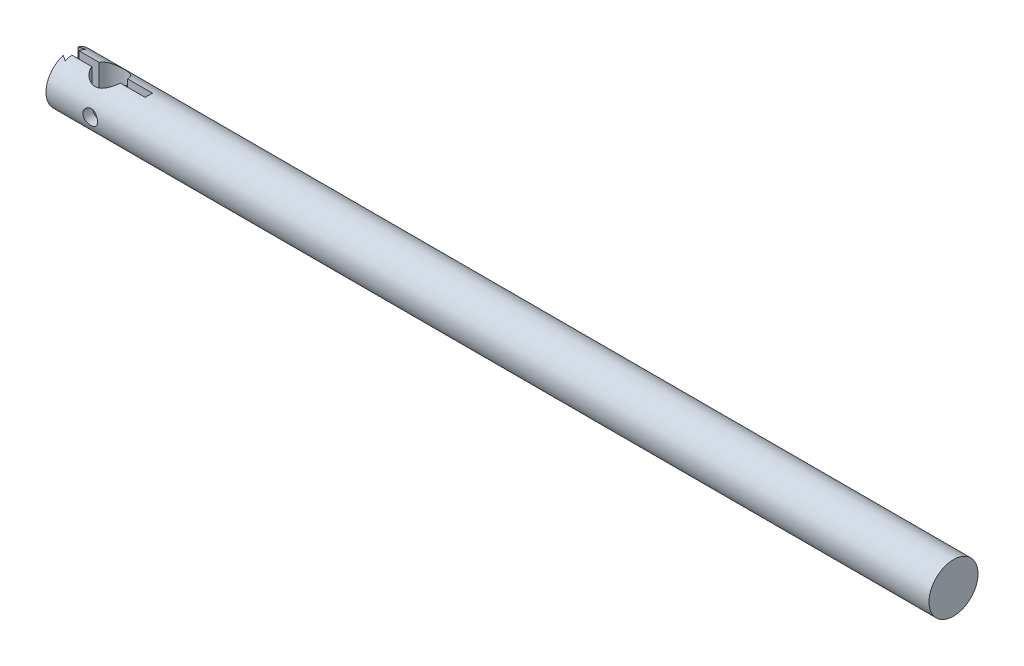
ISO-10303-21;
HEADER;
FILE_DESCRIPTION(('STEP AP214'),'2;1');
FILE_NAME('part.step','',(''),(''),'','','');
FILE_SCHEMA(('AUTOMOTIVE_DESIGN { 1 0 10303 214 1 1 1 1 }'));
ENDSEC;
DATA;
#1=APPLICATION_CONTEXT('core data for automotive mechanical design processes');
#2=APPLICATION_PROTOCOL_DEFINITION('international standard','automotive_design',2000,#1);
#3=PRODUCT_CONTEXT('',#1,'mechanical');
#4=PRODUCT('Part','Part','',(#3));
#5=PRODUCT_RELATED_PRODUCT_CATEGORY('part','',(#4));
#6=PRODUCT_DEFINITION_FORMATION('','',#4);
#7=PRODUCT_DEFINITION_CONTEXT('part definition',#1,'design');
#8=PRODUCT_DEFINITION('design','',#6,#7);
#9=PRODUCT_DEFINITION_SHAPE('','',#8);
#10=(LENGTH_UNIT() NAMED_UNIT(*) SI_UNIT(.MILLI.,.METRE.));
#11=(NAMED_UNIT(*) PLANE_ANGLE_UNIT() SI_UNIT($,.RADIAN.));
#12=(NAMED_UNIT(*) SI_UNIT($,.STERADIAN.) SOLID_ANGLE_UNIT());
#13=UNCERTAINTY_MEASURE_WITH_UNIT(LENGTH_MEASURE(1.E-05),#10,'distance_accuracy_value','');
#14=(GEOMETRIC_REPRESENTATION_CONTEXT(3) GLOBAL_UNCERTAINTY_ASSIGNED_CONTEXT((#13)) GLOBAL_UNIT_ASSIGNED_CONTEXT((#10,
#11,#12)) REPRESENTATION_CONTEXT('',''));
#15=CARTESIAN_POINT('',(0.,0.,0.));
#16=DIRECTION('',(0.,0.,1.));
#17=DIRECTION('',(1.,0.,0.));
#18=AXIS2_PLACEMENT_3D('',#15,#16,#17);
#19=CARTESIAN_POINT('',(1.,-20.,-0.75));
#20=DIRECTION('',(0.,0.,-1.));
#21=DIRECTION('',(-1.,0.,0.));
#22=AXIS2_PLACEMENT_3D('',#19,#20,#21);
#23=PLANE('',#22);
#24=DIRECTION('',(-1.,0.,0.));
#25=VECTOR('',#24,1.);
#26=CARTESIAN_POINT('',(-14.4387919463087,-4.9434299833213,-0.75));
#27=LINE('',#26,#25);
#28=CARTESIAN_POINT('',(5.09526249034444,-4.9434299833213,-0.75));
#29=VERTEX_POINT('',#28);
#30=CARTESIAN_POINT('',(1.,-4.9434299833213,-0.75));
#31=VERTEX_POINT('',#30);
#32=EDGE_CURVE('E153',#29,#31,#27,.T.);
#33=ORIENTED_EDGE('',*,*,#32,.F.);
#34=DIRECTION('',(0.,1.,0.));
#35=VECTOR('',#34,1.);
#36=CARTESIAN_POINT('',(5.09526249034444,-15.,-0.75));
#37=LINE('',#36,#35);
#38=CARTESIAN_POINT('',(5.09526249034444,4.9434299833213,-0.75));
#39=VERTEX_POINT('',#38);
#40=EDGE_CURVE('E243',#29,#39,#37,.T.);
#41=ORIENTED_EDGE('',*,*,#40,.T.);
#42=DIRECTION('',(-1.,0.,0.));
#43=VECTOR('',#42,1.);
#44=CARTESIAN_POINT('',(-14.4387919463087,4.9434299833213,-0.75));
#45=LINE('',#44,#43);
#46=CARTESIAN_POINT('',(1.,4.94342998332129,-0.75));
#47=VERTEX_POINT('',#46);
#48=EDGE_CURVE('E150',#47,#39,#45,.F.);
#49=ORIENTED_EDGE('',*,*,#48,.F.);
#50=DIRECTION('',(0.,1.,0.));
#51=VECTOR('',#50,1.);
#52=CARTESIAN_POINT('',(1.,-20.,-0.75));
#53=LINE('',#52,#51);
#54=EDGE_CURVE('E188',#31,#47,#53,.T.);
#55=ORIENTED_EDGE('',*,*,#54,.F.);
#56=EDGE_LOOP('',(#33,#41,#49,#55));
#57=FACE_BOUND('',#56,.T.);
#58=ADVANCED_FACE('F28',(#57),#23,.F.);
#59=CARTESIAN_POINT('',(16.,-20.,0.75));
#60=DIRECTION('',(0.,0.,1.));
#61=DIRECTION('',(1.,0.,0.));
#62=AXIS2_PLACEMENT_3D('',#59,#60,#61);
#63=PLANE('',#62);
#64=DIRECTION('',(-1.,0.,0.));
#65=VECTOR('',#64,1.);
#66=CARTESIAN_POINT('',(-14.4387919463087,-4.9434299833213,0.750000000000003));
#67=LINE('',#66,#65);
#68=CARTESIAN_POINT('',(10.9047375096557,-4.94342998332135,0.750000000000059));
#69=VERTEX_POINT('',#68);
#70=CARTESIAN_POINT('',(16.,-4.9434299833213,0.75));
#71=VERTEX_POINT('',#70);
#72=EDGE_CURVE('E146',#69,#71,#67,.F.);
#73=ORIENTED_EDGE('',*,*,#72,.F.);
#74=DIRECTION('',(0.,1.,0.));
#75=VECTOR('',#74,1.);
#76=CARTESIAN_POINT('',(10.9047375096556,-15.,0.75));
#77=LINE('',#76,#75);
#78=CARTESIAN_POINT('',(10.9047375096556,4.9434299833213,0.750000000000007));
#79=VERTEX_POINT('',#78);
#80=EDGE_CURVE('E240',#69,#79,#77,.T.);
#81=ORIENTED_EDGE('',*,*,#80,.T.);
#82=DIRECTION('',(-1.,0.,0.));
#83=VECTOR('',#82,1.);
#84=CARTESIAN_POINT('',(-14.4387919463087,4.9434299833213,0.750000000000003));
#85=LINE('',#84,#83);
#86=CARTESIAN_POINT('',(16.,4.94342998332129,0.75));
#87=VERTEX_POINT('',#86);
#88=EDGE_CURVE('E136',#87,#79,#85,.T.);
#89=ORIENTED_EDGE('',*,*,#88,.F.);
#90=DIRECTION('',(0.,1.,0.));
#91=VECTOR('',#90,1.);
#92=CARTESIAN_POINT('',(16.,-20.,0.75));
#93=LINE('',#92,#91);
#94=EDGE_CURVE('E199',#71,#87,#93,.T.);
#95=ORIENTED_EDGE('',*,*,#94,.F.);
#96=EDGE_LOOP('',(#73,#81,#89,#95));
#97=FACE_BOUND('',#96,.T.);
#98=ADVANCED_FACE('F203',(#97),#63,.F.);
#99=CARTESIAN_POINT('',(1.,-20.,2.07735026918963));
#100=DIRECTION('',(1.,0.,0.));
#101=DIRECTION('',(0.,0.,-1.));
#102=AXIS2_PLACEMENT_3D('',#99,#100,#101);
#103=PLANE('',#102);
#104=CARTESIAN_POINT('',(1.,0.,0.));
#105=DIRECTION('',(1.,0.,0.));
#106=DIRECTION('',(0.,0.,-1.));
#107=AXIS2_PLACEMENT_3D('',#104,#105,#106);
#108=CIRCLE('',#107,5.);
#109=CARTESIAN_POINT('',(1.,-4.54803428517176,-2.07735026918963));
#110=VERTEX_POINT('',#109);
#111=EDGE_CURVE('E313',#31,#110,#108,.T.);
#112=ORIENTED_EDGE('',*,*,#111,.F.);
#113=ORIENTED_EDGE('',*,*,#54,.T.);
#114=CARTESIAN_POINT('',(1.,4.54803428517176,-2.07735026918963));
#115=VERTEX_POINT('',#114);
#116=EDGE_CURVE('E179',#115,#47,#108,.T.);
#117=ORIENTED_EDGE('',*,*,#116,.F.);
#118=DIRECTION('',(0.,1.,0.));
#119=VECTOR('',#118,1.);
#120=CARTESIAN_POINT('',(1.,-20.,-2.07735026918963));
#121=LINE('',#120,#119);
#122=EDGE_CURVE('E161',#110,#115,#121,.T.);
#123=ORIENTED_EDGE('',*,*,#122,.F.);
#124=EDGE_LOOP('',(#112,#113,#117,#123));
#125=FACE_BOUND('',#124,.T.);
#126=ADVANCED_FACE('F264',(#125),#103,.F.);
#127=CARTESIAN_POINT('',(0.,0.,0.));
#128=DIRECTION('',(1.,0.,0.));
#129=DIRECTION('',(0.,0.,-1.));
#130=AXIS2_PLACEMENT_3D('',#127,#128,#129);
#131=PLANE('',#130);
#132=CARTESIAN_POINT('',(0.,0.,0.));
#133=DIRECTION('',(-1.,0.,0.));
#134=DIRECTION('',(0.,0.,1.));
#135=AXIS2_PLACEMENT_3D('',#132,#133,#134);
#136=CIRCLE('',#135,5.);
#137=CARTESIAN_POINT('',(0.,4.76969600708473,-1.5));
#138=VERTEX_POINT('',#137);
#139=CARTESIAN_POINT('',(0.,-4.76969600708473,-1.5));
#140=VERTEX_POINT('',#139);
#141=EDGE_CURVE('E173',#138,#140,#136,.T.);
#142=ORIENTED_EDGE('',*,*,#141,.T.);
#143=DIRECTION('',(0.,1.,0.));
#144=VECTOR('',#143,1.);
#145=CARTESIAN_POINT('',(0.,-20.,-1.5));
#146=LINE('',#145,#144);
#147=EDGE_CURVE('E157',#140,#138,#146,.T.);
#148=ORIENTED_EDGE('',*,*,#147,.T.);
#149=EDGE_LOOP('',(#142,#148));
#150=FACE_BOUND('',#149,.T.);
#151=ADVANCED_FACE('F296',(#150),#131,.F.);
#152=CARTESIAN_POINT('',(0.,-4.76969600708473,1.5));
#153=VERTEX_POINT('',#152);
#154=CARTESIAN_POINT('',(0.,4.76969600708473,1.5));
#155=VERTEX_POINT('',#154);
#156=EDGE_CURVE('E170',#153,#155,#136,.T.);
#157=ORIENTED_EDGE('',*,*,#156,.T.);
#158=DIRECTION('',(0.,1.,0.));
#159=VECTOR('',#158,1.);
#160=CARTESIAN_POINT('',(0.,-20.,1.5));
#161=LINE('',#160,#159);
#162=EDGE_CURVE('E156',#153,#155,#161,.T.);
#163=ORIENTED_EDGE('',*,*,#162,.F.);
#164=EDGE_LOOP('',(#157,#163));
#165=FACE_BOUND('',#164,.T.);
#166=ADVANCED_FACE('F30',(#165),#131,.F.);
#167=CARTESIAN_POINT('',(-14.4387919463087,0.,0.));
#168=DIRECTION('',(-1.,0.,0.));
#169=DIRECTION('',(0.,0.,1.));
#170=AXIS2_PLACEMENT_3D('',#167,#168,#169);
#171=CYLINDRICAL_SURFACE('',#170,5.);
#172=CARTESIAN_POINT('',(10.5,0.,5.));
#173=CARTESIAN_POINT('',(10.4999990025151,-0.0822886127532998,4.9999992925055));
#174=CARTESIAN_POINT('',(10.493206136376,-0.164587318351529,4.99794915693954));
#175=CARTESIAN_POINT('',(10.4662786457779,-0.32678812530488,4.98997105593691));
#176=CARTESIAN_POINT('',(10.4461400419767,-0.40668950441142,4.98404193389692));
#177=CARTESIAN_POINT('',(10.3932539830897,-0.561732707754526,4.96895552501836));
#178=CARTESIAN_POINT('',(10.3605251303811,-0.636881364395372,4.95980300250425));
#179=CARTESIAN_POINT('',(10.2834639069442,-0.780624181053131,4.93922109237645));
#180=CARTESIAN_POINT('',(10.2391299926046,-0.849217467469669,4.92779140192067));
#181=CARTESIAN_POINT('',(10.1387759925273,-0.979871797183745,4.90350737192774));
#182=CARTESIAN_POINT('',(10.0824833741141,-1.04171807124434,4.89062383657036));
#183=CARTESIAN_POINT('',(9.96039077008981,-1.15524920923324,4.86505834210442));
#184=CARTESIAN_POINT('',(9.89458918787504,-1.20693236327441,4.85237641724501));
#185=CARTESIAN_POINT('',(9.75352924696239,-1.29980037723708,4.82834113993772));
#186=CARTESIAN_POINT('',(9.67809153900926,-1.34072309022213,4.81702406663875));
#187=CARTESIAN_POINT('',(9.52101074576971,-1.4092139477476,4.79743620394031));
#188=CARTESIAN_POINT('',(9.43936915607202,-1.43678529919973,4.78916468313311));
#189=CARTESIAN_POINT('',(9.27460973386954,-1.47701633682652,4.77690870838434));
#190=CARTESIAN_POINT('',(9.19159725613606,-1.49007196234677,4.77281069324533));
#191=CARTESIAN_POINT('',(9.02446684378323,-1.50213730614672,4.76902789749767));
#192=CARTESIAN_POINT('',(8.94034918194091,-1.50115042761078,4.76934204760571));
#193=CARTESIAN_POINT('',(8.77661609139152,-1.48546977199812,4.77424744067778));
#194=CARTESIAN_POINT('',(8.69694774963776,-1.47127205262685,4.77868388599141));
#195=CARTESIAN_POINT('',(8.54118021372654,-1.43037420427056,4.79108356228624));
#196=CARTESIAN_POINT('',(8.46508137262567,-1.40367284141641,4.79904714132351));
#197=CARTESIAN_POINT('',(8.31739965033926,-1.33816026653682,4.81772733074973));
#198=CARTESIAN_POINT('',(8.24589291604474,-1.29918816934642,4.82848016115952));
#199=CARTESIAN_POINT('',(8.11026797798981,-1.21035222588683,4.85150987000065));
#200=CARTESIAN_POINT('',(8.04615157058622,-1.16048574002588,4.86378711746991));
#201=CARTESIAN_POINT('',(7.92431380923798,-1.04881290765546,4.88911011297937));
#202=CARTESIAN_POINT('',(7.86697133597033,-0.98659490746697,4.90216654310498));
#203=CARTESIAN_POINT('',(7.76344601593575,-0.853263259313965,4.92712244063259));
#204=CARTESIAN_POINT('',(7.71726387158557,-0.782149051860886,4.9390218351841));
#205=CARTESIAN_POINT('',(7.63714007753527,-0.632355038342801,4.9604316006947));
#206=CARTESIAN_POINT('',(7.60328248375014,-0.553627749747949,4.96992543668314));
#207=CARTESIAN_POINT('',(7.54940040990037,-0.391245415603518,4.98533521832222));
#208=CARTESIAN_POINT('',(7.52937207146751,-0.307591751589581,4.99125216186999));
#209=CARTESIAN_POINT('',(7.50434782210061,-0.140952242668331,4.99868364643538));
#210=CARTESIAN_POINT('',(7.49883841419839,-0.0580500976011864,5.0003485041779));
#211=CARTESIAN_POINT('',(7.50156915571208,0.107499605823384,4.9995292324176));
#212=CARTESIAN_POINT('',(7.50980746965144,0.190147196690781,4.99704565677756));
#213=CARTESIAN_POINT('',(7.5393846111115,0.350903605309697,4.98830696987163));
#214=CARTESIAN_POINT('',(7.56042338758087,0.42907277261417,4.98213829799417));
#215=CARTESIAN_POINT('',(7.6146432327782,0.580754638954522,4.96674347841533));
#216=CARTESIAN_POINT('',(7.64782576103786,0.654266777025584,4.95751696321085));
#217=CARTESIAN_POINT('',(7.72625316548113,0.796437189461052,4.93669654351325));
#218=CARTESIAN_POINT('',(7.77175934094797,0.864943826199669,4.92505280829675));
#219=CARTESIAN_POINT('',(7.87322475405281,0.993523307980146,4.90073468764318));
#220=CARTESIAN_POINT('',(7.92918661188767,1.05359403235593,4.8880600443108));
#221=CARTESIAN_POINT('',(8.05238730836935,1.16585744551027,4.86253171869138));
#222=CARTESIAN_POINT('',(8.11996187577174,1.21768481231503,4.84968825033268));
#223=CARTESIAN_POINT('',(8.26312793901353,1.30928995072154,4.82576515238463));
#224=CARTESIAN_POINT('',(8.33871922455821,1.34906803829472,4.81468547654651));
#225=CARTESIAN_POINT('',(8.49553249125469,1.41517347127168,4.79567189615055));
#226=CARTESIAN_POINT('',(8.57672618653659,1.4415634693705,4.78772337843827));
#227=CARTESIAN_POINT('',(8.74268796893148,1.48021730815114,4.77591594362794));
#228=CARTESIAN_POINT('',(8.82745482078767,1.49248598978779,4.772055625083));
#229=CARTESIAN_POINT('',(8.99436151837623,1.50221984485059,4.76899972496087));
#230=CARTESIAN_POINT('',(9.07646365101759,1.5002805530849,4.76961647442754));
#231=CARTESIAN_POINT('',(9.2391141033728,1.48307505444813,4.77499401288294));
#232=CARTESIAN_POINT('',(9.31966248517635,1.46780938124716,4.77975463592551));
#233=CARTESIAN_POINT('',(9.47594539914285,1.42476888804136,4.79275763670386));
#234=CARTESIAN_POINT('',(9.55172728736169,1.39715175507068,4.80095604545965));
#235=CARTESIAN_POINT('',(9.69764243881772,1.33031507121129,4.81990278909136));
#236=CARTESIAN_POINT('',(9.76777461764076,1.29109329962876,4.83065161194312));
#237=CARTESIAN_POINT('',(9.90316311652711,1.20048763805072,4.85397676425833));
#238=CARTESIAN_POINT('',(9.96814876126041,1.14871276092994,4.86660540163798));
#239=CARTESIAN_POINT('',(10.0887024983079,1.03517434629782,4.89201320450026));
#240=CARTESIAN_POINT('',(10.1442681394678,0.973408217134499,4.90479240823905));
#241=CARTESIAN_POINT('',(10.246023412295,0.839465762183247,4.92950936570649));
#242=CARTESIAN_POINT('',(10.2918914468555,0.767037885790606,4.94141159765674));
#243=CARTESIAN_POINT('',(10.370735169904,0.615141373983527,4.96260680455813));
#244=CARTESIAN_POINT('',(10.4037168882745,0.535676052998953,4.97190099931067));
#245=CARTESIAN_POINT('',(10.4528952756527,0.38075771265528,4.98602174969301));
#246=CARTESIAN_POINT('',(10.4705116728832,0.305786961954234,4.99122027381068));
#247=CARTESIAN_POINT('',(10.4940635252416,0.15388019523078,4.99820944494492));
#248=CARTESIAN_POINT('',(10.5000009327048,0.0769445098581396,5.0000006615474));
#249=CARTESIAN_POINT('',(10.5,0.,5.));
#250=B_SPLINE_CURVE_WITH_KNOTS('',3,(#172,#173,#174,#175,#176,#177,#178,#179,#180,#181,#182,
#183,#184,#185,#186,#187,#188,#189,#190,#191,#192,#193,#194,#195,#196,#197,#198,#199,#200,#201,
#202,#203,#204,#205,#206,#207,#208,#209,#210,#211,#212,#213,#214,#215,#216,#217,#218,#219,#220,
#221,#222,#223,#224,#225,#226,#227,#228,#229,#230,#231,#232,#233,#234,#235,#236,#237,#238,#239,
#240,#241,#242,#243,#244,#245,#246,#247,#248,#249),.UNSPECIFIED.,.T.,.F.,(4,2,2,2,2,2,2,2,2,2,2,
2,2,2,2,2,2,2,2,2,2,2,2,2,2,2,2,2,2,2,2,2,2,2,2,2,2,2,4),(0.,0.24658320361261,0.493239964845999,
0.739533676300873,0.985860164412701,1.23855602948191,1.49129437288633,1.74971481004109,
2.00807314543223,2.25919689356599,2.51025978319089,2.75226016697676,2.99428443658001,
3.23962426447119,3.48502360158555,3.74067104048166,3.99633456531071,4.25371046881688,
4.51101453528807,4.75908809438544,5.00712853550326,5.24956746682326,5.49203554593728,
5.74011305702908,5.9882528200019,6.24540400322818,6.5025484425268,6.75847814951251,
7.01432009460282,7.25950155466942,7.50467319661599,7.7468004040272,7.98897397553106,
8.2399692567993,8.49102974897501,8.7494299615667,9.00770911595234,9.23831691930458,
9.46888616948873),.UNSPECIFIED.);
#251=CARTESIAN_POINT('',(10.5,0.,5.));
#252=VERTEX_POINT('',#251);
#253=EDGE_CURVE('E204',#252,#252,#250,.T.);
#254=ORIENTED_EDGE('',*,*,#253,.T.);
#255=EDGE_LOOP('',(#254));
#256=FACE_BOUND('',#255,.T.);
#257=CARTESIAN_POINT('',(10.5,0.,-5.));
#258=CARTESIAN_POINT('',(10.4999990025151,0.0822886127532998,-4.9999992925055));
#259=CARTESIAN_POINT('',(10.493206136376,0.164587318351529,-4.99794915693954));
#260=CARTESIAN_POINT('',(10.4662786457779,0.32678812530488,-4.98997105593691));
#261=CARTESIAN_POINT('',(10.4461400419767,0.40668950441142,-4.98404193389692));
#262=CARTESIAN_POINT('',(10.3932539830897,0.561732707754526,-4.96895552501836));
#263=CARTESIAN_POINT('',(10.3605251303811,0.636881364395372,-4.95980300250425));
#264=CARTESIAN_POINT('',(10.2834639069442,0.780624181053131,-4.93922109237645));
#265=CARTESIAN_POINT('',(10.2391299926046,0.849217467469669,-4.92779140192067));
#266=CARTESIAN_POINT('',(10.1387759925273,0.979871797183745,-4.90350737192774));
#267=CARTESIAN_POINT('',(10.0824833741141,1.04171807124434,-4.89062383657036));
#268=CARTESIAN_POINT('',(9.96039077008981,1.15524920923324,-4.86505834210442));
#269=CARTESIAN_POINT('',(9.89458918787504,1.20693236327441,-4.85237641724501));
#270=CARTESIAN_POINT('',(9.75352924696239,1.29980037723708,-4.82834113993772));
#271=CARTESIAN_POINT('',(9.67809153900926,1.34072309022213,-4.81702406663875));
#272=CARTESIAN_POINT('',(9.52101074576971,1.4092139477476,-4.79743620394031));
#273=CARTESIAN_POINT('',(9.43936915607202,1.43678529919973,-4.78916468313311));
#274=CARTESIAN_POINT('',(9.27460973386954,1.47701633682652,-4.77690870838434));
#275=CARTESIAN_POINT('',(9.19159725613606,1.49007196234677,-4.77281069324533));
#276=CARTESIAN_POINT('',(9.02446684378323,1.50213730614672,-4.76902789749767));
#277=CARTESIAN_POINT('',(8.94034918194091,1.50115042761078,-4.76934204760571));
#278=CARTESIAN_POINT('',(8.77661609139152,1.48546977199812,-4.77424744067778));
#279=CARTESIAN_POINT('',(8.69694774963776,1.47127205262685,-4.77868388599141));
#280=CARTESIAN_POINT('',(8.54118021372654,1.43037420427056,-4.79108356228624));
#281=CARTESIAN_POINT('',(8.46508137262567,1.40367284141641,-4.79904714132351));
#282=CARTESIAN_POINT('',(8.31739965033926,1.33816026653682,-4.81772733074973));
#283=CARTESIAN_POINT('',(8.24589291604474,1.29918816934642,-4.82848016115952));
#284=CARTESIAN_POINT('',(8.11026797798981,1.21035222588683,-4.85150987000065));
#285=CARTESIAN_POINT('',(8.04615157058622,1.16048574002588,-4.86378711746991));
#286=CARTESIAN_POINT('',(7.92431380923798,1.04881290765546,-4.88911011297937));
#287=CARTESIAN_POINT('',(7.86697133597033,0.98659490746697,-4.90216654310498));
#288=CARTESIAN_POINT('',(7.76344601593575,0.853263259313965,-4.92712244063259));
#289=CARTESIAN_POINT('',(7.71726387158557,0.782149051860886,-4.9390218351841));
#290=CARTESIAN_POINT('',(7.63714007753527,0.632355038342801,-4.9604316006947));
#291=CARTESIAN_POINT('',(7.60328248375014,0.553627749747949,-4.96992543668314));
#292=CARTESIAN_POINT('',(7.54940040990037,0.391245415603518,-4.98533521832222));
#293=CARTESIAN_POINT('',(7.52937207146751,0.307591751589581,-4.99125216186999));
#294=CARTESIAN_POINT('',(7.50434782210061,0.140952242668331,-4.99868364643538));
#295=CARTESIAN_POINT('',(7.49883841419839,0.0580500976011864,-5.0003485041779));
#296=CARTESIAN_POINT('',(7.50156915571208,-0.107499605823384,-4.9995292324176));
#297=CARTESIAN_POINT('',(7.50980746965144,-0.190147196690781,-4.99704565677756));
#298=CARTESIAN_POINT('',(7.5393846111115,-0.350903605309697,-4.98830696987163));
#299=CARTESIAN_POINT('',(7.56042338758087,-0.42907277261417,-4.98213829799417));
#300=CARTESIAN_POINT('',(7.6146432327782,-0.580754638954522,-4.96674347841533));
#301=CARTESIAN_POINT('',(7.64782576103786,-0.654266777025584,-4.95751696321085));
#302=CARTESIAN_POINT('',(7.72625316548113,-0.796437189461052,-4.93669654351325));
#303=CARTESIAN_POINT('',(7.77175934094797,-0.864943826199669,-4.92505280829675));
#304=CARTESIAN_POINT('',(7.87322475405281,-0.993523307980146,-4.90073468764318));
#305=CARTESIAN_POINT('',(7.92918661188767,-1.05359403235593,-4.8880600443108));
#306=CARTESIAN_POINT('',(8.05238730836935,-1.16585744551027,-4.86253171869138));
#307=CARTESIAN_POINT('',(8.11996187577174,-1.21768481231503,-4.84968825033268));
#308=CARTESIAN_POINT('',(8.26312793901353,-1.30928995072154,-4.82576515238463));
#309=CARTESIAN_POINT('',(8.33871922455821,-1.34906803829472,-4.81468547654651));
#310=CARTESIAN_POINT('',(8.49553249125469,-1.41517347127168,-4.79567189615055));
#311=CARTESIAN_POINT('',(8.57672618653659,-1.4415634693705,-4.78772337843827));
#312=CARTESIAN_POINT('',(8.74268796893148,-1.48021730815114,-4.77591594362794));
#313=CARTESIAN_POINT('',(8.82745482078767,-1.49248598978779,-4.772055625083));
#314=CARTESIAN_POINT('',(8.99436151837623,-1.50221984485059,-4.76899972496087));
#315=CARTESIAN_POINT('',(9.07646365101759,-1.5002805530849,-4.76961647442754));
#316=CARTESIAN_POINT('',(9.2391141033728,-1.48307505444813,-4.77499401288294));
#317=CARTESIAN_POINT('',(9.31966248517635,-1.46780938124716,-4.77975463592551));
#318=CARTESIAN_POINT('',(9.47594539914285,-1.42476888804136,-4.79275763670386));
#319=CARTESIAN_POINT('',(9.55172728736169,-1.39715175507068,-4.80095604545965));
#320=CARTESIAN_POINT('',(9.69764243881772,-1.33031507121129,-4.81990278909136));
#321=CARTESIAN_POINT('',(9.76777461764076,-1.29109329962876,-4.83065161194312));
#322=CARTESIAN_POINT('',(9.90316311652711,-1.20048763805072,-4.85397676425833));
#323=CARTESIAN_POINT('',(9.96814876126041,-1.14871276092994,-4.86660540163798));
#324=CARTESIAN_POINT('',(10.0887024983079,-1.03517434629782,-4.89201320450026));
#325=CARTESIAN_POINT('',(10.1442681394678,-0.973408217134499,-4.90479240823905));
#326=CARTESIAN_POINT('',(10.246023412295,-0.839465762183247,-4.92950936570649));
#327=CARTESIAN_POINT('',(10.2918914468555,-0.767037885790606,-4.94141159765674));
#328=CARTESIAN_POINT('',(10.370735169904,-0.615141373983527,-4.96260680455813));
#329=CARTESIAN_POINT('',(10.4037168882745,-0.535676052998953,-4.97190099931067));
#330=CARTESIAN_POINT('',(10.4528952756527,-0.38075771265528,-4.98602174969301));
#331=CARTESIAN_POINT('',(10.4705116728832,-0.305786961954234,-4.99122027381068));
#332=CARTESIAN_POINT('',(10.4940635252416,-0.15388019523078,-4.99820944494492));
#333=CARTESIAN_POINT('',(10.5000009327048,-0.0769445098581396,-5.0000006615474));
#334=CARTESIAN_POINT('',(10.5,0.,-5.));
#335=B_SPLINE_CURVE_WITH_KNOTS('',3,(#257,#258,#259,#260,#261,#262,#263,#264,#265,#266,#267,
#268,#269,#270,#271,#272,#273,#274,#275,#276,#277,#278,#279,#280,#281,#282,#283,#284,#285,#286,
#287,#288,#289,#290,#291,#292,#293,#294,#295,#296,#297,#298,#299,#300,#301,#302,#303,#304,#305,
#306,#307,#308,#309,#310,#311,#312,#313,#314,#315,#316,#317,#318,#319,#320,#321,#322,#323,#324,
#325,#326,#327,#328,#329,#330,#331,#332,#333,#334),.UNSPECIFIED.,.T.,.F.,(4,2,2,2,2,2,2,2,2,2,2,
2,2,2,2,2,2,2,2,2,2,2,2,2,2,2,2,2,2,2,2,2,2,2,2,2,2,2,4),(0.,0.24658320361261,0.493239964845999,
0.739533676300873,0.985860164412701,1.23855602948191,1.49129437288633,1.74971481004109,
2.00807314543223,2.25919689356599,2.51025978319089,2.75226016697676,2.99428443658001,
3.23962426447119,3.48502360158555,3.74067104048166,3.99633456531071,4.25371046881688,
4.51101453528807,4.75908809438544,5.00712853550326,5.24956746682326,5.49203554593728,
5.74011305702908,5.9882528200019,6.24540400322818,6.5025484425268,6.75847814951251,
7.01432009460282,7.25950155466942,7.50467319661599,7.7468004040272,7.98897397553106,
8.2399692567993,8.49102974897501,8.7494299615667,9.00770911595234,9.23831691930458,
9.46888616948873),.UNSPECIFIED.);
#336=CARTESIAN_POINT('',(10.5,0.,-5.));
#337=VERTEX_POINT('',#336);
#338=EDGE_CURVE('E207',#337,#337,#335,.T.);
#339=ORIENTED_EDGE('',*,*,#338,.T.);
#340=EDGE_LOOP('',(#339));
#341=FACE_BOUND('',#340,.T.);
#342=CARTESIAN_POINT('',(16.,-4.9434299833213,-0.75));
#343=VERTEX_POINT('',#342);
#344=CARTESIAN_POINT('',(10.9047375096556,-4.9434299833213,-0.75));
#345=VERTEX_POINT('',#344);
#346=EDGE_CURVE('E154',#343,#345,#27,.T.);
#347=ORIENTED_EDGE('',*,*,#346,.T.);
#348=CARTESIAN_POINT('',(8.,-4.,3.));
#349=CARTESIAN_POINT('',(8.07546161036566,-3.99999997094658,2.9999999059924));
#350=CARTESIAN_POINT('',(8.15091995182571,-4.00214560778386,2.99714660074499));
#351=CARTESIAN_POINT('',(8.30118357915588,-4.01061905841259,2.98579602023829));
#352=CARTESIAN_POINT('',(8.37598860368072,-4.01694847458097,2.97729658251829));
#353=CARTESIAN_POINT('',(8.59854240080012,-4.04185988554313,2.94350195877));
#354=CARTESIAN_POINT('',(8.74446616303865,-4.06636523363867,2.90991036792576));
#355=CARTESIAN_POINT('',(9.02619529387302,-4.1272446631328,2.82286888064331));
#356=CARTESIAN_POINT('',(9.16206540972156,-4.16353284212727,2.76956233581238));
#357=CARTESIAN_POINT('',(9.42286717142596,-4.24371857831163,2.64505893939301));
#358=CARTESIAN_POINT('',(9.54779553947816,-4.28761840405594,2.5738567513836));
#359=CARTESIAN_POINT('',(9.79990131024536,-4.3845721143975,2.40542341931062));
#360=CARTESIAN_POINT('',(9.92548608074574,-4.43808896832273,2.30607419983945));
#361=CARTESIAN_POINT('',(10.1595253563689,-4.54452303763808,2.08854542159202));
#362=CARTESIAN_POINT('',(10.2679669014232,-4.59743977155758,1.97035175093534));
#363=CARTESIAN_POINT('',(10.4762824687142,-4.70351798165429,1.70284578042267));
#364=CARTESIAN_POINT('',(10.5739664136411,-4.75608869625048,1.55155129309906));
#365=CARTESIAN_POINT('',(10.699746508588,-4.82570563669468,1.31132430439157));
#366=CARTESIAN_POINT('',(10.7382241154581,-4.84737661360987,1.22900736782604));
#367=CARTESIAN_POINT('',(10.8077909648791,-4.88701002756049,1.06047221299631));
#368=CARTESIAN_POINT('',(10.8388850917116,-4.90497491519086,0.974256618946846));
#369=CARTESIAN_POINT('',(10.8906274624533,-4.9351119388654,0.806968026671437));
#370=CARTESIAN_POINT('',(10.9119872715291,-4.94767216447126,0.726184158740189));
#371=CARTESIAN_POINT('',(10.947949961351,-4.96892323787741,0.562666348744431));
#372=CARTESIAN_POINT('',(10.9625566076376,-4.97761624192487,0.479933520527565));
#373=CARTESIAN_POINT('',(10.9847846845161,-4.99087754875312,0.313244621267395));
#374=CARTESIAN_POINT('',(10.9924098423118,-4.99544805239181,0.229289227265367));
#375=CARTESIAN_POINT('',(11.0005666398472,-5.00033941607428,0.0609397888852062));
#376=CARTESIAN_POINT('',(11.0010990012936,-5.00066070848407,-0.0234542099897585));
#377=CARTESIAN_POINT('',(10.9927572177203,-4.99565270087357,-0.255171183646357));
#378=CARTESIAN_POINT('',(10.9765288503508,-4.98590479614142,-0.402219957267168));
#379=CARTESIAN_POINT('',(10.9230445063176,-4.95416390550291,-0.690956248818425));
#380=CARTESIAN_POINT('',(10.8857869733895,-4.9321700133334,-0.832643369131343));
#381=CARTESIAN_POINT('',(10.791667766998,-4.87769707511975,-1.10810607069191));
#382=CARTESIAN_POINT('',(10.7346935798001,-4.84515792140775,-1.2418309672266));
#383=CARTESIAN_POINT('',(10.6032310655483,-4.77219304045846,-1.49797933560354));
#384=CARTESIAN_POINT('',(10.5287381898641,-4.73176526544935,-1.62039986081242));
#385=CARTESIAN_POINT('',(10.3543217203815,-4.64075842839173,-1.86614789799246));
#386=CARTESIAN_POINT('',(10.2524233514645,-4.58954363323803,-1.98783715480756));
#387=CARTESIAN_POINT('',(10.0311917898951,-4.48511110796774,-2.2134294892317));
#388=CARTESIAN_POINT('',(9.91183500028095,-4.43189074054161,-2.31730807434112));
#389=CARTESIAN_POINT('',(9.64269317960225,-4.32222149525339,-2.51649670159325));
#390=CARTESIAN_POINT('',(9.4909848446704,-4.26611322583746,-2.60941864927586));
#391=CARTESIAN_POINT('',(9.17058753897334,-4.16501759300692,-2.76794435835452));
#392=CARTESIAN_POINT('',(9.00193056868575,-4.12000980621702,-2.83359844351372));
#393=CARTESIAN_POINT('',(8.69521273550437,-4.05791730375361,-2.92154993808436));
#394=CARTESIAN_POINT('',(8.55991873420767,-4.03667777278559,-2.95055806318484));
#395=CARTESIAN_POINT('',(8.28525278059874,-4.00784301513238,-2.98961745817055));
#396=CARTESIAN_POINT('',(8.14588576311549,-4.00023192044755,-2.9996907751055));
#397=CARTESIAN_POINT('',(7.86689663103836,-3.9997782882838,-3.00029561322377));
#398=CARTESIAN_POINT('',(7.72727443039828,-4.00695621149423,-2.99080006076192));
#399=CARTESIAN_POINT('',(7.45202532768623,-4.03503040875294,-2.95280584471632));
#400=CARTESIAN_POINT('',(7.31640167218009,-4.05593752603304,-2.92429216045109));
#401=CARTESIAN_POINT('',(7.05257078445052,-4.10863539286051,-2.84976612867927));
#402=CARTESIAN_POINT('',(6.92435451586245,-4.14041253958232,-2.80377564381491));
#403=CARTESIAN_POINT('',(6.67704477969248,-4.21143069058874,-2.69592568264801));
#404=CARTESIAN_POINT('',(6.5579547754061,-4.25067450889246,-2.63406022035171));
#405=CARTESIAN_POINT('',(6.30951890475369,-4.34073681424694,-2.48334675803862));
#406=CARTESIAN_POINT('',(6.18219456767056,-4.39236652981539,-2.391645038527));
#407=CARTESIAN_POINT('',(5.94343279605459,-4.49643335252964,-2.18975614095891));
#408=CARTESIAN_POINT('',(5.83201075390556,-4.54887118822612,-2.07955127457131));
#409=CARTESIAN_POINT('',(5.61353600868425,-4.65671991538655,-1.82651475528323));
#410=CARTESIAN_POINT('',(5.50893529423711,-4.71163080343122,-1.68130397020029));
#411=CARTESIAN_POINT('',(5.37184550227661,-4.78599458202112,-1.44944631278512));
#412=CARTESIAN_POINT('',(5.32943799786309,-4.80945640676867,-1.36978605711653));
#413=CARTESIAN_POINT('',(5.25169611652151,-4.85305400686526,-1.20623656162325));
#414=CARTESIAN_POINT('',(5.2163572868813,-4.87319187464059,-1.12235002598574));
#415=CARTESIAN_POINT('',(5.15552035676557,-4.90820667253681,-0.957140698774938));
#416=CARTESIAN_POINT('',(5.12949628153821,-4.9233583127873,-0.876069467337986));
#417=CARTESIAN_POINT('',(5.08433501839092,-4.94982497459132,-0.711460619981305));
#418=CARTESIAN_POINT('',(5.06519397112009,-4.96114214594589,-0.627924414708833));
#419=CARTESIAN_POINT('',(5.03409969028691,-4.9795990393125,-0.459119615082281));
#420=CARTESIAN_POINT('',(5.02214156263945,-4.98674160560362,-0.373852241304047));
#421=CARTESIAN_POINT('',(5.00559323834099,-4.99664216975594,-0.202384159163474));
#422=CARTESIAN_POINT('',(5.00100208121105,-4.99940073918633,-0.116183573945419));
#423=CARTESIAN_POINT('',(4.9986717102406,-5.00079353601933,0.11951938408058));
#424=CARTESIAN_POINT('',(5.0083989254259,-4.9949361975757,0.269213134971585));
#425=CARTESIAN_POINT('',(5.04978205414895,-4.97026391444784,0.564325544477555));
#426=CARTESIAN_POINT('',(5.08143821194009,-4.95144882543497,0.70974415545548));
#427=CARTESIAN_POINT('',(5.16444057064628,-4.90298726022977,0.990283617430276));
#428=CARTESIAN_POINT('',(5.215463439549,-4.87351900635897,1.1255320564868));
#429=CARTESIAN_POINT('',(5.33528094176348,-4.8060670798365,1.38556595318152));
#430=CARTESIAN_POINT('',(5.40407956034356,-4.76808149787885,1.51034905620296));
#431=CARTESIAN_POINT('',(5.56584990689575,-4.68186861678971,1.76052652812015));
#432=CARTESIAN_POINT('',(5.66063506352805,-4.63297714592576,1.88451663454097));
#433=CARTESIAN_POINT('',(5.86750842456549,-4.5320378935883,2.11579577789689));
#434=CARTESIAN_POINT('',(5.97961579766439,-4.47998665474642,2.22306604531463));
#435=CARTESIAN_POINT('',(6.23456104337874,-4.37056449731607,2.43181699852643));
#436=CARTESIAN_POINT('',(6.3794930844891,-4.31335603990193,2.53083841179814));
#437=CARTESIAN_POINT('',(6.68700957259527,-4.20752457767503,2.70314606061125));
#438=CARTESIAN_POINT('',(6.84958478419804,-4.15889711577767,2.77644567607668));
#439=CARTESIAN_POINT('',(7.09662255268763,-4.10004730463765,2.86193484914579));
#440=CARTESIAN_POINT('',(7.17565859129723,-4.0832950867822,2.88571236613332));
#441=CARTESIAN_POINT('',(7.33613044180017,-4.05395087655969,2.92679381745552));
#442=CARTESIAN_POINT('',(7.41756469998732,-4.04135625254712,2.94410184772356));
#443=CARTESIAN_POINT('',(7.58204655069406,-4.0209497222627,2.97191221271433));
#444=CARTESIAN_POINT('',(7.66509136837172,-4.01313023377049,2.98242533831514));
#445=CARTESIAN_POINT('',(7.83209221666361,-4.00265571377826,2.99646884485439));
#446=CARTESIAN_POINT('',(7.91604813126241,-4.00000003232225,3.00000010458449));
#447=CARTESIAN_POINT('',(8.,-4.,3.));
#448=B_SPLINE_CURVE_WITH_KNOTS('',3,(#348,#349,#350,#351,#352,#353,#354,#355,#356,#357,#358,
#359,#360,#361,#362,#363,#364,#365,#366,#367,#368,#369,#370,#371,#372,#373,#374,#375,#376,#377,
#378,#379,#380,#381,#382,#383,#384,#385,#386,#387,#388,#389,#390,#391,#392,#393,#394,#395,#396,
#397,#398,#399,#400,#401,#402,#403,#404,#405,#406,#407,#408,#409,#410,#411,#412,#413,#414,#415,
#416,#417,#418,#419,#420,#421,#422,#423,#424,#425,#426,#427,#428,#429,#430,#431,#432,#433,#434,
#435,#436,#437,#438,#439,#440,#441,#442,#443,#444,#445,#446,#447),.UNSPECIFIED.,.T.,.F.,(4,2,2,
2,2,2,2,2,2,2,2,2,2,2,2,2,2,2,2,2,2,2,2,2,2,2,2,2,2,2,2,2,2,2,2,2,2,2,2,2,2,2,2,2,2,2,2,2,2,4),
(0.,0.226288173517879,0.452663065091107,0.905305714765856,1.35471981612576,1.80426809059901,
2.30878181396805,2.81367513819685,3.37309572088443,3.65297634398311,3.93267130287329,
4.18580566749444,4.43879871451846,4.6916566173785,4.94448879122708,5.38694235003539,
5.82942865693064,6.27448283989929,6.71965270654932,7.21799594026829,7.71701907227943,
8.27387316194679,8.82969494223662,9.24786570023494,9.66554925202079,10.0838110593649,
10.5024036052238,10.9204742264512,11.3387027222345,11.8323285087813,12.3264288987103,
12.884776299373,13.1641700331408,13.4433872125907,13.7024631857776,13.9613936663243,
14.2201475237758,14.4788676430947,14.9267946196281,15.3747265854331,15.8154875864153,
16.2563474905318,16.7450674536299,17.2343321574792,17.7856420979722,18.3366648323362,
18.5890061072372,18.8411873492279,19.0929671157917,19.3447151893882),.UNSPECIFIED.);
#449=EDGE_CURVE('E48',#345,#29,#448,.T.);
#450=ORIENTED_EDGE('',*,*,#449,.T.);
#451=ORIENTED_EDGE('',*,*,#32,.T.);
#452=ORIENTED_EDGE('',*,*,#111,.T.);
#453=CARTESIAN_POINT('',(-2.59807621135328,0.,0.));
#454=DIRECTION('',(-0.500000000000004,0.,-0.866025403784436));
#455=DIRECTION('',(-0.866025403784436,0.,0.500000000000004));
#456=AXIS2_PLACEMENT_3D('',#453,#454,#455);
#457=ELLIPSE('',#456,9.99999999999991,5.);
#458=EDGE_CURVE('E186',#110,#140,#457,.T.);
#459=ORIENTED_EDGE('',*,*,#458,.T.);
#460=ORIENTED_EDGE('',*,*,#141,.F.);
#461=EDGE_CURVE('E182',#138,#115,#457,.T.);
#462=ORIENTED_EDGE('',*,*,#461,.T.);
#463=ORIENTED_EDGE('',*,*,#116,.T.);
#464=ORIENTED_EDGE('',*,*,#48,.T.);
#465=CARTESIAN_POINT('',(8.,4.,3.));
#466=CARTESIAN_POINT('',(7.92453838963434,3.99999997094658,2.9999999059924));
#467=CARTESIAN_POINT('',(7.84908004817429,4.00214560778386,2.99714660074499));
#468=CARTESIAN_POINT('',(7.69881642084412,4.01061905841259,2.98579602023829));
#469=CARTESIAN_POINT('',(7.62401139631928,4.01694847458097,2.97729658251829));
#470=CARTESIAN_POINT('',(7.40145759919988,4.04185988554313,2.94350195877));
#471=CARTESIAN_POINT('',(7.25553383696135,4.06636523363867,2.90991036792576));
#472=CARTESIAN_POINT('',(6.97380470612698,4.1272446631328,2.82286888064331));
#473=CARTESIAN_POINT('',(6.83793459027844,4.16353284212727,2.76956233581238));
#474=CARTESIAN_POINT('',(6.57713282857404,4.24371857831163,2.64505893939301));
#475=CARTESIAN_POINT('',(6.45220446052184,4.28761840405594,2.57385675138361));
#476=CARTESIAN_POINT('',(6.20009868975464,4.3845721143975,2.40542341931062));
#477=CARTESIAN_POINT('',(6.07451391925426,4.43808896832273,2.30607419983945));
#478=CARTESIAN_POINT('',(5.84047464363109,4.54452303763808,2.08854542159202));
#479=CARTESIAN_POINT('',(5.73203309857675,4.59743977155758,1.97035175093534));
#480=CARTESIAN_POINT('',(5.52371753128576,4.70351798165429,1.70284578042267));
#481=CARTESIAN_POINT('',(5.42603358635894,4.75608869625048,1.55155129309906));
#482=CARTESIAN_POINT('',(5.30025349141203,4.82570563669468,1.31132430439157));
#483=CARTESIAN_POINT('',(5.26177588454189,4.84737661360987,1.22900736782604));
#484=CARTESIAN_POINT('',(5.19220903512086,4.88701002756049,1.06047221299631));
#485=CARTESIAN_POINT('',(5.16111490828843,4.90497491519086,0.974256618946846));
#486=CARTESIAN_POINT('',(5.10937253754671,4.9351119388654,0.806968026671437));
#487=CARTESIAN_POINT('',(5.0880127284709,4.94767216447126,0.726184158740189));
#488=CARTESIAN_POINT('',(5.05205003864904,4.96892323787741,0.562666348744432));
#489=CARTESIAN_POINT('',(5.0374433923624,4.97761624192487,0.479933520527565));
#490=CARTESIAN_POINT('',(5.01521531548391,4.99087754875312,0.313244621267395));
#491=CARTESIAN_POINT('',(5.0075901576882,4.99544805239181,0.229289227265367));
#492=CARTESIAN_POINT('',(4.99943336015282,5.00033941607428,0.0609397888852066));
#493=CARTESIAN_POINT('',(4.99890099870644,5.00066070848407,-0.023454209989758));
#494=CARTESIAN_POINT('',(5.00724278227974,4.99565270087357,-0.255171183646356));
#495=CARTESIAN_POINT('',(5.02347114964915,4.98590479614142,-0.402219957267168));
#496=CARTESIAN_POINT('',(5.07695549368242,4.95416390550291,-0.690956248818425));
#497=CARTESIAN_POINT('',(5.1142130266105,4.9321700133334,-0.832643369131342));
#498=CARTESIAN_POINT('',(5.20833223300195,4.87769707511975,-1.10810607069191));
#499=CARTESIAN_POINT('',(5.26530642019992,4.84515792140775,-1.2418309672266));
#500=CARTESIAN_POINT('',(5.3967689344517,4.77219304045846,-1.49797933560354));
#501=CARTESIAN_POINT('',(5.47126181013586,4.73176526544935,-1.62039986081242));
#502=CARTESIAN_POINT('',(5.64567827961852,4.64075842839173,-1.86614789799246));
#503=CARTESIAN_POINT('',(5.74757664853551,4.58954363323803,-1.98783715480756));
#504=CARTESIAN_POINT('',(5.96880821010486,4.48511110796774,-2.2134294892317));
#505=CARTESIAN_POINT('',(6.08816499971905,4.43189074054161,-2.31730807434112));
#506=CARTESIAN_POINT('',(6.35730682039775,4.32222149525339,-2.51649670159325));
#507=CARTESIAN_POINT('',(6.5090151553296,4.26611322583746,-2.60941864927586));
#508=CARTESIAN_POINT('',(6.82941246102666,4.16501759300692,-2.76794435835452));
#509=CARTESIAN_POINT('',(6.99806943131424,4.12000980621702,-2.83359844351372));
#510=CARTESIAN_POINT('',(7.30478726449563,4.05791730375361,-2.92154993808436));
#511=CARTESIAN_POINT('',(7.44008126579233,4.03667777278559,-2.95055806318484));
#512=CARTESIAN_POINT('',(7.71474721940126,4.00784301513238,-2.98961745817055));
#513=CARTESIAN_POINT('',(7.85411423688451,4.00023192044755,-2.9996907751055));
#514=CARTESIAN_POINT('',(8.13310336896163,3.9997782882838,-3.00029561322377));
#515=CARTESIAN_POINT('',(8.27272556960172,4.00695621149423,-2.99080006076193));
#516=CARTESIAN_POINT('',(8.54797467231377,4.03503040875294,-2.95280584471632));
#517=CARTESIAN_POINT('',(8.68359832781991,4.05593752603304,-2.92429216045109));
#518=CARTESIAN_POINT('',(8.94742921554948,4.10863539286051,-2.84976612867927));
#519=CARTESIAN_POINT('',(9.07564548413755,4.14041253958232,-2.80377564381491));
#520=CARTESIAN_POINT('',(9.32295522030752,4.21143069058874,-2.69592568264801));
#521=CARTESIAN_POINT('',(9.4420452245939,4.25067450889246,-2.63406022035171));
#522=CARTESIAN_POINT('',(9.69048109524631,4.34073681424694,-2.48334675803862));
#523=CARTESIAN_POINT('',(9.81780543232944,4.39236652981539,-2.391645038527));
#524=CARTESIAN_POINT('',(10.0565672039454,4.49643335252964,-2.18975614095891));
#525=CARTESIAN_POINT('',(10.1679892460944,4.54887118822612,-2.07955127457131));
#526=CARTESIAN_POINT('',(10.3864639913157,4.65671991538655,-1.82651475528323));
#527=CARTESIAN_POINT('',(10.4910647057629,4.71163080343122,-1.68130397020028));
#528=CARTESIAN_POINT('',(10.6281544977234,4.78599458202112,-1.44944631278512));
#529=CARTESIAN_POINT('',(10.6705620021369,4.80945640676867,-1.36978605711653));
#530=CARTESIAN_POINT('',(10.7483038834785,4.85305400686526,-1.20623656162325));
#531=CARTESIAN_POINT('',(10.7836427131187,4.87319187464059,-1.12235002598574));
#532=CARTESIAN_POINT('',(10.8444796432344,4.90820667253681,-0.957140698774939));
#533=CARTESIAN_POINT('',(10.8705037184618,4.9233583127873,-0.876069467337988));
#534=CARTESIAN_POINT('',(10.9156649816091,4.94982497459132,-0.711460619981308));
#535=CARTESIAN_POINT('',(10.9348060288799,4.96114214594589,-0.627924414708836));
#536=CARTESIAN_POINT('',(10.9659003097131,4.9795990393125,-0.459119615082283));
#537=CARTESIAN_POINT('',(10.9778584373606,4.98674160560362,-0.373852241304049));
#538=CARTESIAN_POINT('',(10.994406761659,4.99664216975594,-0.202384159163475));
#539=CARTESIAN_POINT('',(10.998997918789,4.99940073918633,-0.11618357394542));
#540=CARTESIAN_POINT('',(11.0013282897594,5.00079353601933,0.119519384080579));
#541=CARTESIAN_POINT('',(10.9916010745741,4.9949361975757,0.269213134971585));
#542=CARTESIAN_POINT('',(10.9502179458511,4.97026391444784,0.564325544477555));
#543=CARTESIAN_POINT('',(10.9185617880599,4.95144882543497,0.70974415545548));
#544=CARTESIAN_POINT('',(10.8355594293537,4.90298726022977,0.990283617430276));
#545=CARTESIAN_POINT('',(10.784536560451,4.87351900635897,1.1255320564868));
#546=CARTESIAN_POINT('',(10.6647190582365,4.8060670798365,1.38556595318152));
#547=CARTESIAN_POINT('',(10.5959204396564,4.76808149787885,1.51034905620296));
#548=CARTESIAN_POINT('',(10.4341500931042,4.68186861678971,1.76052652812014));
#549=CARTESIAN_POINT('',(10.339364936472,4.63297714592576,1.88451663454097));
#550=CARTESIAN_POINT('',(10.1324915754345,4.5320378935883,2.11579577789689));
#551=CARTESIAN_POINT('',(10.0203842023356,4.47998665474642,2.22306604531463));
#552=CARTESIAN_POINT('',(9.76543895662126,4.37056449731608,2.43181699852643));
#553=CARTESIAN_POINT('',(9.6205069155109,4.31335603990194,2.53083841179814));
#554=CARTESIAN_POINT('',(9.31299042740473,4.20752457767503,2.70314606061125));
#555=CARTESIAN_POINT('',(9.15041521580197,4.15889711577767,2.77644567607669));
#556=CARTESIAN_POINT('',(8.90337744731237,4.10004730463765,2.86193484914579));
#557=CARTESIAN_POINT('',(8.82434140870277,4.0832950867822,2.88571236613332));
#558=CARTESIAN_POINT('',(8.66386955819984,4.05395087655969,2.92679381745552));
#559=CARTESIAN_POINT('',(8.58243530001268,4.04135625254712,2.94410184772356));
#560=CARTESIAN_POINT('',(8.41795344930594,4.0209497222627,2.97191221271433));
#561=CARTESIAN_POINT('',(8.33490863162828,4.01313023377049,2.98242533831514));
#562=CARTESIAN_POINT('',(8.16790778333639,4.00265571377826,2.99646884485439));
#563=CARTESIAN_POINT('',(8.08395186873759,4.00000003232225,3.00000010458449));
#564=CARTESIAN_POINT('',(8.,4.,3.));
#565=B_SPLINE_CURVE_WITH_KNOTS('',3,(#465,#466,#467,#468,#469,#470,#471,#472,#473,#474,#475,
#476,#477,#478,#479,#480,#481,#482,#483,#484,#485,#486,#487,#488,#489,#490,#491,#492,#493,#494,
#495,#496,#497,#498,#499,#500,#501,#502,#503,#504,#505,#506,#507,#508,#509,#510,#511,#512,#513,
#514,#515,#516,#517,#518,#519,#520,#521,#522,#523,#524,#525,#526,#527,#528,#529,#530,#531,#532,
#533,#534,#535,#536,#537,#538,#539,#540,#541,#542,#543,#544,#545,#546,#547,#548,#549,#550,#551,
#552,#553,#554,#555,#556,#557,#558,#559,#560,#561,#562,#563,#564),.UNSPECIFIED.,.T.,.F.,(4,2,2,
2,2,2,2,2,2,2,2,2,2,2,2,2,2,2,2,2,2,2,2,2,2,2,2,2,2,2,2,2,2,2,2,2,2,2,2,2,2,2,2,2,2,2,2,2,2,4),
(0.,0.226288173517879,0.452663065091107,0.905305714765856,1.35471981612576,1.804268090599,
2.30878181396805,2.81367513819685,3.37309572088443,3.65297634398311,3.93267130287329,
4.18580566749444,4.43879871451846,4.6916566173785,4.94448879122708,5.38694235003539,
5.82942865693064,6.27448283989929,6.71965270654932,7.21799594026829,7.71701907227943,
8.27387316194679,8.82969494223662,9.24786570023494,9.66554925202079,10.0838110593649,
10.5024036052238,10.9204742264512,11.3387027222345,11.8323285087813,12.3264288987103,
12.884776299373,13.1641700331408,13.4433872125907,13.7024631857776,13.9613936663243,
14.2201475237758,14.4788676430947,14.9267946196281,15.3747265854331,15.8154875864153,
16.2563474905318,16.7450674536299,17.2343321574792,17.7856420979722,18.3366648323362,
18.5890061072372,18.8411873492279,19.0929671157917,19.3447151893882),.UNSPECIFIED.);
#566=CARTESIAN_POINT('',(10.9047375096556,4.94342998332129,-0.75));
#567=VERTEX_POINT('',#566);
#568=EDGE_CURVE('E138',#39,#567,#565,.T.);
#569=ORIENTED_EDGE('',*,*,#568,.T.);
#570=CARTESIAN_POINT('',(16.,4.9434299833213,-0.75));
#571=VERTEX_POINT('',#570);
#572=EDGE_CURVE('E145',#567,#571,#45,.F.);
#573=ORIENTED_EDGE('',*,*,#572,.T.);
#574=CARTESIAN_POINT('',(16.,0.,0.));
#575=DIRECTION('',(1.,0.,0.));
#576=DIRECTION('',(0.,0.,-1.));
#577=AXIS2_PLACEMENT_3D('',#574,#575,#576);
#578=CIRCLE('',#577,5.);
#579=EDGE_CURVE('E11',#571,#87,#578,.T.);
#580=ORIENTED_EDGE('',*,*,#579,.T.);
#581=ORIENTED_EDGE('',*,*,#88,.T.);
#582=CARTESIAN_POINT('',(5.09526249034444,4.94342998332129,0.750000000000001));
#583=VERTEX_POINT('',#582);
#584=EDGE_CURVE('E122',#79,#583,#565,.T.);
#585=ORIENTED_EDGE('',*,*,#584,.T.);
#586=CARTESIAN_POINT('',(1.,4.94342998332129,0.750000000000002));
#587=VERTEX_POINT('',#586);
#588=EDGE_CURVE('E134',#583,#587,#85,.T.);
#589=ORIENTED_EDGE('',*,*,#588,.T.);
#590=CARTESIAN_POINT('',(1.,4.54803428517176,2.07735026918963));
#591=VERTEX_POINT('',#590);
#592=EDGE_CURVE('E177',#587,#591,#108,.T.);
#593=ORIENTED_EDGE('',*,*,#592,.T.);
#594=CARTESIAN_POINT('',(-2.59807621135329,0.,0.));
#595=DIRECTION('',(-0.500000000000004,0.,0.866025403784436));
#596=DIRECTION('',(-0.866025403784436,0.,-0.500000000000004));
#597=AXIS2_PLACEMENT_3D('',#594,#595,#596);
#598=ELLIPSE('',#597,9.99999999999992,5.);
#599=EDGE_CURVE('E174',#591,#155,#598,.T.);
#600=ORIENTED_EDGE('',*,*,#599,.T.);
#601=ORIENTED_EDGE('',*,*,#156,.F.);
#602=CARTESIAN_POINT('',(1.,-4.54803428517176,2.07735026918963));
#603=VERTEX_POINT('',#602);
#604=EDGE_CURVE('E178',#153,#603,#598,.T.);
#605=ORIENTED_EDGE('',*,*,#604,.T.);
#606=CARTESIAN_POINT('',(1.,-4.9434299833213,0.750000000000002));
#607=VERTEX_POINT('',#606);
#608=EDGE_CURVE('E183',#603,#607,#108,.T.);
#609=ORIENTED_EDGE('',*,*,#608,.T.);
#610=CARTESIAN_POINT('',(5.09526249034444,-4.9434299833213,0.750000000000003));
#611=VERTEX_POINT('',#610);
#612=EDGE_CURVE('E143',#607,#611,#67,.F.);
#613=ORIENTED_EDGE('',*,*,#612,.T.);
#614=EDGE_CURVE('E56',#611,#69,#448,.T.);
#615=ORIENTED_EDGE('',*,*,#614,.T.);
#616=ORIENTED_EDGE('',*,*,#72,.T.);
#617=EDGE_CURVE('E41',#71,#343,#578,.T.);
#618=ORIENTED_EDGE('',*,*,#617,.T.);
#619=EDGE_LOOP('',(#347,#450,#451,#452,#459,#460,#462,#463,#464,#569,#573,#580,#581,#585,#589,
#593,#600,#601,#605,#609,#613,#615,#616,#618));
#620=FACE_BOUND('',#619,.T.);
#621=CARTESIAN_POINT('',(180.,0.,0.));
#622=DIRECTION('',(-1.,0.,0.));
#623=DIRECTION('',(0.,0.,1.));
#624=AXIS2_PLACEMENT_3D('',#621,#622,#623);
#625=CIRCLE('',#624,5.);
#626=CARTESIAN_POINT('',(180.,0.,5.));
#627=VERTEX_POINT('',#626);
#628=EDGE_CURVE('E160',#627,#627,#625,.T.);
#629=ORIENTED_EDGE('',*,*,#628,.T.);
#630=EDGE_LOOP('',(#629));
#631=FACE_BOUND('',#630,.T.);
#632=ADVANCED_FACE('F132',(#256,#341,#620,#631),#171,.T.);
#633=CARTESIAN_POINT('',(180.,5.,0.));
#634=DIRECTION('',(-1.,0.,0.));
#635=DIRECTION('',(0.,0.,1.));
#636=AXIS2_PLACEMENT_3D('',#633,#634,#635);
#637=PLANE('',#636);
#638=ORIENTED_EDGE('',*,*,#628,.F.);
#639=EDGE_LOOP('',(#638));
#640=FACE_BOUND('',#639,.T.);
#641=ADVANCED_FACE('F282',(#640),#637,.F.);
#642=CARTESIAN_POINT('',(1.,-20.,-2.07735026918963));
#643=DIRECTION('',(-0.500000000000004,0.,-0.866025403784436));
#644=DIRECTION('',(-0.866025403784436,0.,0.500000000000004));
#645=AXIS2_PLACEMENT_3D('',#642,#643,#644);
#646=PLANE('',#645);
#647=ORIENTED_EDGE('',*,*,#147,.F.);
#648=ORIENTED_EDGE('',*,*,#458,.F.);
#649=ORIENTED_EDGE('',*,*,#122,.T.);
#650=ORIENTED_EDGE('',*,*,#461,.F.);
#651=EDGE_LOOP('',(#647,#648,#649,#650));
#652=FACE_BOUND('',#651,.T.);
#653=ADVANCED_FACE('F279',(#652),#646,.F.);
#654=ORIENTED_EDGE('',*,*,#592,.F.);
#655=DIRECTION('',(0.,-1.,0.));
#656=VECTOR('',#655,1.);
#657=CARTESIAN_POINT('',(1.,-20.,0.750000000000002));
#658=LINE('',#657,#656);
#659=EDGE_CURVE('E141',#587,#607,#658,.T.);
#660=ORIENTED_EDGE('',*,*,#659,.T.);
#661=ORIENTED_EDGE('',*,*,#608,.F.);
#662=DIRECTION('',(0.,1.,0.));
#663=VECTOR('',#662,1.);
#664=CARTESIAN_POINT('',(1.,-20.,2.07735026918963));
#665=LINE('',#664,#663);
#666=EDGE_CURVE('E164',#603,#591,#665,.T.);
#667=ORIENTED_EDGE('',*,*,#666,.T.);
#668=EDGE_LOOP('',(#654,#660,#661,#667));
#669=FACE_BOUND('',#668,.T.);
#670=ADVANCED_FACE('F275',(#669),#103,.F.);
#671=CARTESIAN_POINT('',(0.,-20.,1.5));
#672=DIRECTION('',(-0.500000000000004,0.,0.866025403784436));
#673=DIRECTION('',(0.866025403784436,0.,0.500000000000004));
#674=AXIS2_PLACEMENT_3D('',#671,#672,#673);
#675=PLANE('',#674);
#676=ORIENTED_EDGE('',*,*,#162,.T.);
#677=ORIENTED_EDGE('',*,*,#599,.F.);
#678=ORIENTED_EDGE('',*,*,#666,.F.);
#679=ORIENTED_EDGE('',*,*,#604,.F.);
#680=EDGE_LOOP('',(#676,#677,#678,#679));
#681=FACE_BOUND('',#680,.T.);
#682=ADVANCED_FACE('F271',(#681),#675,.F.);
#683=CARTESIAN_POINT('',(16.,-20.,-0.75));
#684=DIRECTION('',(1.,0.,0.));
#685=DIRECTION('',(0.,0.,-1.));
#686=AXIS2_PLACEMENT_3D('',#683,#684,#685);
#687=PLANE('',#686);
#688=DIRECTION('',(0.,1.,0.));
#689=VECTOR('',#688,1.);
#690=CARTESIAN_POINT('',(16.,-20.,-0.75));
#691=LINE('',#690,#689);
#692=EDGE_CURVE('E201',#343,#571,#691,.T.);
#693=ORIENTED_EDGE('',*,*,#692,.F.);
#694=ORIENTED_EDGE('',*,*,#617,.F.);
#695=ORIENTED_EDGE('',*,*,#94,.T.);
#696=ORIENTED_EDGE('',*,*,#579,.F.);
#697=EDGE_LOOP('',(#693,#694,#695,#696));
#698=FACE_BOUND('',#697,.T.);
#699=ADVANCED_FACE('F197',(#698),#687,.F.);
#700=ORIENTED_EDGE('',*,*,#572,.F.);
#701=DIRECTION('',(0.,1.,0.));
#702=VECTOR('',#701,1.);
#703=CARTESIAN_POINT('',(10.9047375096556,-15.,-0.75));
#704=LINE('',#703,#702);
#705=EDGE_CURVE('E242',#567,#345,#704,.F.);
#706=ORIENTED_EDGE('',*,*,#705,.T.);
#707=ORIENTED_EDGE('',*,*,#346,.F.);
#708=ORIENTED_EDGE('',*,*,#692,.T.);
#709=EDGE_LOOP('',(#700,#706,#707,#708));
#710=FACE_BOUND('',#709,.T.);
#711=ADVANCED_FACE('F225',(#710),#23,.F.);
#712=ORIENTED_EDGE('',*,*,#588,.F.);
#713=DIRECTION('',(0.,1.,0.));
#714=VECTOR('',#713,1.);
#715=CARTESIAN_POINT('',(5.09526249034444,-15.,0.750000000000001));
#716=LINE('',#715,#714);
#717=EDGE_CURVE('E119',#583,#611,#716,.F.);
#718=ORIENTED_EDGE('',*,*,#717,.T.);
#719=ORIENTED_EDGE('',*,*,#612,.F.);
#720=ORIENTED_EDGE('',*,*,#659,.F.);
#721=EDGE_LOOP('',(#712,#718,#719,#720));
#722=FACE_BOUND('',#721,.T.);
#723=ADVANCED_FACE('F139',(#722),#63,.F.);
#724=CARTESIAN_POINT('',(9.,0.,-20.));
#725=DIRECTION('',(0.,0.,1.));
#726=DIRECTION('',(1.,0.,0.));
#727=AXIS2_PLACEMENT_3D('',#724,#725,#726);
#728=CYLINDRICAL_SURFACE('',#727,1.5);
#729=CARTESIAN_POINT('',(10.5,0.,1.6583123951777));
#730=CARTESIAN_POINT('',(10.4999961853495,-0.0514515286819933,1.65832065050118));
#731=CARTESIAN_POINT('',(10.4973216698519,-0.102979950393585,1.66237165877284));
#732=CARTESIAN_POINT('',(10.4868892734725,-0.204404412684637,1.67793390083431));
#733=CARTESIAN_POINT('',(10.4791174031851,-0.254295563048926,1.68946566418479));
#734=CARTESIAN_POINT('',(10.4558935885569,-0.366965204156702,1.7231131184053));
#735=CARTESIAN_POINT('',(10.4387751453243,-0.428725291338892,1.74744038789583));
#736=CARTESIAN_POINT('',(10.3981524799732,-0.546898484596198,1.80278934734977));
#737=CARTESIAN_POINT('',(10.3746312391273,-0.603296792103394,1.83382883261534));
#738=CARTESIAN_POINT('',(10.3069613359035,-0.742168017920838,1.91893799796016));
#739=CARTESIAN_POINT('',(10.2587518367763,-0.820848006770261,1.97594201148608));
#740=CARTESIAN_POINT('',(10.1505209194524,-0.966721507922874,2.09324880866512));
#741=CARTESIAN_POINT('',(10.090482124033,-1.0338978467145,2.15355634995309));
#742=CARTESIAN_POINT('',(9.95651884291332,-1.15922760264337,2.27609327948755));
#743=CARTESIAN_POINT('',(9.88213513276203,-1.21691284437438,2.33830309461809));
#744=CARTESIAN_POINT('',(9.72171932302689,-1.31836839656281,2.45880365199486));
#745=CARTESIAN_POINT('',(9.63570734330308,-1.36216231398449,2.51710090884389));
#746=CARTESIAN_POINT('',(9.47101095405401,-1.42630459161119,2.61600099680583));
#747=CARTESIAN_POINT('',(9.39420489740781,-1.44956833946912,2.65783036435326));
#748=CARTESIAN_POINT('',(9.23494385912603,-1.48371852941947,2.73545961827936));
#749=CARTESIAN_POINT('',(9.15249182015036,-1.49461136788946,2.77126261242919));
#750=CARTESIAN_POINT('',(8.98342286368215,-1.50230829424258,2.83568564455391));
#751=CARTESIAN_POINT('',(8.89678002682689,-1.4990093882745,2.86425157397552));
#752=CARTESIAN_POINT('',(8.72311185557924,-1.4768128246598,2.91294067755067));
#753=CARTESIAN_POINT('',(8.63608682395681,-1.45792585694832,2.93306962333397));
#754=CARTESIAN_POINT('',(8.47585872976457,-1.40764119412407,2.96300381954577));
#755=CARTESIAN_POINT('',(8.40226247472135,-1.37804584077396,2.97376735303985));
#756=CARTESIAN_POINT('',(8.26020353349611,-1.307285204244,2.98954873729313));
#757=CARTESIAN_POINT('',(8.19174050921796,-1.26612068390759,2.99456696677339));
#758=CARTESIAN_POINT('',(8.06380598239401,-1.17455256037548,2.99998874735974));
#759=CARTESIAN_POINT('',(8.00414802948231,-1.12441481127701,3.00050804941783));
#760=CARTESIAN_POINT('',(7.89333353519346,-1.01554225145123,2.99861605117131));
#761=CARTESIAN_POINT('',(7.84217880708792,-0.956805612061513,2.99620412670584));
#762=CARTESIAN_POINT('',(7.7471215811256,-0.828843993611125,2.98972375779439));
#763=CARTESIAN_POINT('',(7.70375319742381,-0.759226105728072,2.98557362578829));
#764=CARTESIAN_POINT('',(7.62891947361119,-0.613859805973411,2.97720041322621));
#765=CARTESIAN_POINT('',(7.5974561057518,-0.538110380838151,2.97297732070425));
#766=CARTESIAN_POINT('',(7.54646039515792,-0.379927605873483,2.96563549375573));
#767=CARTESIAN_POINT('',(7.52734403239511,-0.297357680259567,2.96255661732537));
#768=CARTESIAN_POINT('',(7.50327009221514,-0.130132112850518,2.9586164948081));
#769=CARTESIAN_POINT('',(7.49831097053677,-0.0454766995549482,2.95775500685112));
#770=CARTESIAN_POINT('',(7.50267756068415,0.122490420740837,2.95849178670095));
#771=CARTESIAN_POINT('',(7.51184216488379,0.205806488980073,2.96006231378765));
#772=CARTESIAN_POINT('',(7.54387668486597,0.369700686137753,2.96516621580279));
#773=CARTESIAN_POINT('',(7.56674802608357,0.450278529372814,2.96869979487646));
#774=CARTESIAN_POINT('',(7.62557659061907,0.606584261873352,2.97669005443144));
#775=CARTESIAN_POINT('',(7.66155253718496,0.682305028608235,2.98114805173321));
#776=CARTESIAN_POINT('',(7.74561845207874,0.82674689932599,2.98949293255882));
#777=CARTESIAN_POINT('',(7.79371012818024,0.89546701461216,2.99337973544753));
#778=CARTESIAN_POINT('',(7.90125250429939,1.02463802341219,2.99886127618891));
#779=CARTESIAN_POINT('',(7.96080946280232,1.08500168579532,3.00043327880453));
#780=CARTESIAN_POINT('',(8.08921589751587,1.19482262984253,2.9993581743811));
#781=CARTESIAN_POINT('',(8.15806166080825,1.24428424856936,2.99671274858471));
#782=CARTESIAN_POINT('',(8.29992701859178,1.32908162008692,2.98578295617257));
#783=CARTESIAN_POINT('',(8.37267903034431,1.36489314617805,2.97772258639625));
#784=CARTESIAN_POINT('',(8.52211302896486,1.42410585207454,2.95518118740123));
#785=CARTESIAN_POINT('',(8.59879351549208,1.44751173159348,2.94070259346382));
#786=CARTESIAN_POINT('',(8.7496836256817,1.48088909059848,2.90580260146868));
#787=CARTESIAN_POINT('',(8.82383853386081,1.49144372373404,2.8856947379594));
#788=CARTESIAN_POINT('',(8.97102806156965,1.50153477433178,2.83955232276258));
#789=CARTESIAN_POINT('',(9.04406243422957,1.50106879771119,2.81351648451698));
#790=CARTESIAN_POINT('',(9.19015866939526,1.48977549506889,2.75499017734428));
#791=CARTESIAN_POINT('',(9.26309675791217,1.47852046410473,2.72227730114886));
#792=CARTESIAN_POINT('',(9.40438047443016,1.44628280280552,2.65215896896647));
#793=CARTESIAN_POINT('',(9.47272476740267,1.42529735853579,2.61475215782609));
#794=CARTESIAN_POINT('',(9.613861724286,1.37102927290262,2.53045097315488));
#795=CARTESIAN_POINT('',(9.68577527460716,1.33637101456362,2.48297605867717));
#796=CARTESIAN_POINT('',(9.82180917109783,1.25731153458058,2.38496512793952));
#797=CARTESIAN_POINT('',(9.88591872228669,1.2128970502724,2.33442501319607));
#798=CARTESIAN_POINT('',(10.0181700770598,1.10544226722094,2.22170754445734));
#799=CARTESIAN_POINT('',(10.0844894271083,1.0404512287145,2.15925017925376));
#800=CARTESIAN_POINT('',(10.2048208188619,0.898377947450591,2.03620184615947));
#801=CARTESIAN_POINT('',(10.258843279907,0.821306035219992,1.97560933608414));
#802=CARTESIAN_POINT('',(10.3346304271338,0.687117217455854,1.88454806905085));
#803=CARTESIAN_POINT('',(10.3607180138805,0.634104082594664,1.85161743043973));
#804=CARTESIAN_POINT('',(10.4071935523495,0.522903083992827,1.79077454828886));
#805=CARTESIAN_POINT('',(10.4275899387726,0.464723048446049,1.76285490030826));
#806=CARTESIAN_POINT('',(10.4578030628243,0.356680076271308,1.72038692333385));
#807=CARTESIAN_POINT('',(10.4689626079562,0.307830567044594,1.70424657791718));
#808=CARTESIAN_POINT('',(10.4864246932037,0.207616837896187,1.67867178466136));
#809=CARTESIAN_POINT('',(10.4927427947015,0.156261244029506,1.66921585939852));
#810=CARTESIAN_POINT('',(10.4975732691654,0.0870521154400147,1.66196590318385));
#811=CARTESIAN_POINT('',(10.4984814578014,0.0696862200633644,1.66059984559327));
#812=CARTESIAN_POINT('',(10.4996955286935,0.0348831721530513,1.65877160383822));
#813=CARTESIAN_POINT('',(10.5000012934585,0.0174460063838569,1.65830959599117));
#814=CARTESIAN_POINT('',(10.5,0.,1.6583123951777));
#815=B_SPLINE_CURVE_WITH_KNOTS('',3,(#729,#730,#731,#732,#733,#734,#735,#736,#737,#738,#739,
#740,#741,#742,#743,#744,#745,#746,#747,#748,#749,#750,#751,#752,#753,#754,#755,#756,#757,#758,
#759,#760,#761,#762,#763,#764,#765,#766,#767,#768,#769,#770,#771,#772,#773,#774,#775,#776,#777,
#778,#779,#780,#781,#782,#783,#784,#785,#786,#787,#788,#789,#790,#791,#792,#793,#794,#795,#796,
#797,#798,#799,#800,#801,#802,#803,#804,#805,#806,#807,#808,#809,#810,#811,#812,#813,#814),
.UNSPECIFIED.,.T.,.F.,(4,2,2,2,2,2,2,2,2,2,2,2,2,2,2,2,2,2,2,2,2,2,2,2,2,2,2,2,2,2,2,2,2,2,2,2,
2,2,2,2,2,2,4),(0.,0.154278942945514,0.308983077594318,0.513463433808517,0.718492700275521,
1.0421455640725,1.3662774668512,1.70336961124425,2.03988579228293,2.31031336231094,
2.58060104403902,2.85285358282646,3.12491957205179,3.3638742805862,3.60281323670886,
3.83558578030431,4.06840789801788,4.31368055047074,4.55899381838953,4.81219173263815,
5.06536202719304,5.31566574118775,5.56599549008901,5.81668431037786,6.06740848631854,
6.32057914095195,6.57364889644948,6.8168465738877,7.05995205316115,7.29155707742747,
7.52321241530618,7.76444804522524,8.00575348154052,8.28338403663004,8.56139436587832,
8.89582954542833,9.22998028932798,9.43246164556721,9.63464129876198,9.79202401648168,
9.94889872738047,10.0012008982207,10.0535132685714),.UNSPECIFIED.);
#816=CARTESIAN_POINT('',(10.5,0.,1.6583123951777));
#817=VERTEX_POINT('',#816);
#818=EDGE_CURVE('E127',#817,#817,#815,.T.);
#819=ORIENTED_EDGE('',*,*,#818,.T.);
#820=EDGE_LOOP('',(#819));
#821=FACE_BOUND('',#820,.T.);
#822=ORIENTED_EDGE('',*,*,#253,.F.);
#823=EDGE_LOOP('',(#822));
#824=FACE_BOUND('',#823,.T.);
#825=ADVANCED_FACE('F217',(#821,#824),#728,.F.);
#826=CARTESIAN_POINT('',(10.5,0.,-1.6583123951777));
#827=CARTESIAN_POINT('',(10.4999961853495,0.0514515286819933,-1.65832065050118));
#828=CARTESIAN_POINT('',(10.4973216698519,0.102979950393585,-1.66237165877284));
#829=CARTESIAN_POINT('',(10.4868892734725,0.204404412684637,-1.67793390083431));
#830=CARTESIAN_POINT('',(10.4791174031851,0.254295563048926,-1.68946566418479));
#831=CARTESIAN_POINT('',(10.4558935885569,0.366965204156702,-1.7231131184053));
#832=CARTESIAN_POINT('',(10.4387751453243,0.428725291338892,-1.74744038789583));
#833=CARTESIAN_POINT('',(10.3981524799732,0.546898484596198,-1.80278934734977));
#834=CARTESIAN_POINT('',(10.3746312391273,0.603296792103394,-1.83382883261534));
#835=CARTESIAN_POINT('',(10.3069613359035,0.742168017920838,-1.91893799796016));
#836=CARTESIAN_POINT('',(10.2587518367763,0.820848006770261,-1.97594201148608));
#837=CARTESIAN_POINT('',(10.1505209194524,0.966721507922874,-2.09324880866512));
#838=CARTESIAN_POINT('',(10.090482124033,1.0338978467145,-2.15355634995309));
#839=CARTESIAN_POINT('',(9.95651884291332,1.15922760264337,-2.27609327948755));
#840=CARTESIAN_POINT('',(9.88213513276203,1.21691284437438,-2.33830309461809));
#841=CARTESIAN_POINT('',(9.72171932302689,1.31836839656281,-2.45880365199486));
#842=CARTESIAN_POINT('',(9.63570734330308,1.36216231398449,-2.51710090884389));
#843=CARTESIAN_POINT('',(9.47101095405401,1.42630459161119,-2.61600099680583));
#844=CARTESIAN_POINT('',(9.39420489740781,1.44956833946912,-2.65783036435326));
#845=CARTESIAN_POINT('',(9.23494385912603,1.48371852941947,-2.73545961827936));
#846=CARTESIAN_POINT('',(9.15249182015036,1.49461136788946,-2.77126261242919));
#847=CARTESIAN_POINT('',(8.98342286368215,1.50230829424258,-2.83568564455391));
#848=CARTESIAN_POINT('',(8.89678002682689,1.4990093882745,-2.86425157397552));
#849=CARTESIAN_POINT('',(8.72311185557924,1.4768128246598,-2.91294067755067));
#850=CARTESIAN_POINT('',(8.63608682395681,1.45792585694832,-2.93306962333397));
#851=CARTESIAN_POINT('',(8.47585872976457,1.40764119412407,-2.96300381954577));
#852=CARTESIAN_POINT('',(8.40226247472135,1.37804584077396,-2.97376735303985));
#853=CARTESIAN_POINT('',(8.26020353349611,1.307285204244,-2.98954873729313));
#854=CARTESIAN_POINT('',(8.19174050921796,1.26612068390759,-2.99456696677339));
#855=CARTESIAN_POINT('',(8.06380598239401,1.17455256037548,-2.99998874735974));
#856=CARTESIAN_POINT('',(8.00414802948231,1.12441481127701,-3.00050804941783));
#857=CARTESIAN_POINT('',(7.89333353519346,1.01554225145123,-2.99861605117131));
#858=CARTESIAN_POINT('',(7.84217880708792,0.956805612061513,-2.99620412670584));
#859=CARTESIAN_POINT('',(7.7471215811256,0.828843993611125,-2.98972375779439));
#860=CARTESIAN_POINT('',(7.70375319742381,0.759226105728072,-2.98557362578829));
#861=CARTESIAN_POINT('',(7.62891947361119,0.613859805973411,-2.97720041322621));
#862=CARTESIAN_POINT('',(7.5974561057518,0.538110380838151,-2.97297732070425));
#863=CARTESIAN_POINT('',(7.54646039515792,0.379927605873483,-2.96563549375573));
#864=CARTESIAN_POINT('',(7.52734403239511,0.297357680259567,-2.96255661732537));
#865=CARTESIAN_POINT('',(7.50327009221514,0.130132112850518,-2.9586164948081));
#866=CARTESIAN_POINT('',(7.49831097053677,0.0454766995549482,-2.95775500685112));
#867=CARTESIAN_POINT('',(7.50267756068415,-0.122490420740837,-2.95849178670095));
#868=CARTESIAN_POINT('',(7.51184216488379,-0.205806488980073,-2.96006231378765));
#869=CARTESIAN_POINT('',(7.54387668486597,-0.369700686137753,-2.96516621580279));
#870=CARTESIAN_POINT('',(7.56674802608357,-0.450278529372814,-2.96869979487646));
#871=CARTESIAN_POINT('',(7.62557659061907,-0.606584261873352,-2.97669005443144));
#872=CARTESIAN_POINT('',(7.66155253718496,-0.682305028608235,-2.98114805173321));
#873=CARTESIAN_POINT('',(7.74561845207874,-0.82674689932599,-2.98949293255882));
#874=CARTESIAN_POINT('',(7.79371012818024,-0.89546701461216,-2.99337973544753));
#875=CARTESIAN_POINT('',(7.90125250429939,-1.02463802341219,-2.99886127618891));
#876=CARTESIAN_POINT('',(7.96080946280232,-1.08500168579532,-3.00043327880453));
#877=CARTESIAN_POINT('',(8.08921589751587,-1.19482262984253,-2.9993581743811));
#878=CARTESIAN_POINT('',(8.15806166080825,-1.24428424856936,-2.99671274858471));
#879=CARTESIAN_POINT('',(8.29992701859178,-1.32908162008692,-2.98578295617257));
#880=CARTESIAN_POINT('',(8.37267903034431,-1.36489314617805,-2.97772258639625));
#881=CARTESIAN_POINT('',(8.52211302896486,-1.42410585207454,-2.95518118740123));
#882=CARTESIAN_POINT('',(8.59879351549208,-1.44751173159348,-2.94070259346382));
#883=CARTESIAN_POINT('',(8.7496836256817,-1.48088909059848,-2.90580260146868));
#884=CARTESIAN_POINT('',(8.82383853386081,-1.49144372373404,-2.8856947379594));
#885=CARTESIAN_POINT('',(8.97102806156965,-1.50153477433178,-2.83955232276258));
#886=CARTESIAN_POINT('',(9.04406243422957,-1.50106879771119,-2.81351648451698));
#887=CARTESIAN_POINT('',(9.19015866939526,-1.48977549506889,-2.75499017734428));
#888=CARTESIAN_POINT('',(9.26309675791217,-1.47852046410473,-2.72227730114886));
#889=CARTESIAN_POINT('',(9.40438047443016,-1.44628280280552,-2.65215896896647));
#890=CARTESIAN_POINT('',(9.47272476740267,-1.42529735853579,-2.61475215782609));
#891=CARTESIAN_POINT('',(9.613861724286,-1.37102927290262,-2.53045097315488));
#892=CARTESIAN_POINT('',(9.68577527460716,-1.33637101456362,-2.48297605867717));
#893=CARTESIAN_POINT('',(9.82180917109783,-1.25731153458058,-2.38496512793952));
#894=CARTESIAN_POINT('',(9.88591872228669,-1.2128970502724,-2.33442501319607));
#895=CARTESIAN_POINT('',(10.0181700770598,-1.10544226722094,-2.22170754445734));
#896=CARTESIAN_POINT('',(10.0844894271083,-1.0404512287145,-2.15925017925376));
#897=CARTESIAN_POINT('',(10.2048208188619,-0.898377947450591,-2.03620184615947));
#898=CARTESIAN_POINT('',(10.258843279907,-0.821306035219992,-1.97560933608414));
#899=CARTESIAN_POINT('',(10.3346304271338,-0.687117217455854,-1.88454806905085));
#900=CARTESIAN_POINT('',(10.3607180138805,-0.634104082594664,-1.85161743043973));
#901=CARTESIAN_POINT('',(10.4071935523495,-0.522903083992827,-1.79077454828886));
#902=CARTESIAN_POINT('',(10.4275899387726,-0.464723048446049,-1.76285490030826));
#903=CARTESIAN_POINT('',(10.4578030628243,-0.356680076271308,-1.72038692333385));
#904=CARTESIAN_POINT('',(10.4689626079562,-0.307830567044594,-1.70424657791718));
#905=CARTESIAN_POINT('',(10.4864246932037,-0.207616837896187,-1.67867178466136));
#906=CARTESIAN_POINT('',(10.4927427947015,-0.156261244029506,-1.66921585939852));
#907=CARTESIAN_POINT('',(10.4975732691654,-0.0870521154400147,-1.66196590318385));
#908=CARTESIAN_POINT('',(10.4984814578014,-0.0696862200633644,-1.66059984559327));
#909=CARTESIAN_POINT('',(10.4996955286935,-0.0348831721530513,-1.65877160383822));
#910=CARTESIAN_POINT('',(10.5000012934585,-0.0174460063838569,-1.65830959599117));
#911=CARTESIAN_POINT('',(10.5,0.,-1.6583123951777));
#912=B_SPLINE_CURVE_WITH_KNOTS('',3,(#826,#827,#828,#829,#830,#831,#832,#833,#834,#835,#836,
#837,#838,#839,#840,#841,#842,#843,#844,#845,#846,#847,#848,#849,#850,#851,#852,#853,#854,#855,
#856,#857,#858,#859,#860,#861,#862,#863,#864,#865,#866,#867,#868,#869,#870,#871,#872,#873,#874,
#875,#876,#877,#878,#879,#880,#881,#882,#883,#884,#885,#886,#887,#888,#889,#890,#891,#892,#893,
#894,#895,#896,#897,#898,#899,#900,#901,#902,#903,#904,#905,#906,#907,#908,#909,#910,#911),
.UNSPECIFIED.,.T.,.F.,(4,2,2,2,2,2,2,2,2,2,2,2,2,2,2,2,2,2,2,2,2,2,2,2,2,2,2,2,2,2,2,2,2,2,2,2,
2,2,2,2,2,2,4),(0.,0.154278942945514,0.308983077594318,0.513463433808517,0.718492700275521,
1.0421455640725,1.3662774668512,1.70336961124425,2.03988579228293,2.31031336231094,
2.58060104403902,2.85285358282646,3.12491957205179,3.3638742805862,3.60281323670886,
3.83558578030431,4.06840789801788,4.31368055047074,4.55899381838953,4.81219173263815,
5.06536202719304,5.31566574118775,5.56599549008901,5.81668431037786,6.06740848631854,
6.32057914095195,6.57364889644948,6.8168465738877,7.05995205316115,7.29155707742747,
7.52321241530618,7.76444804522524,8.00575348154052,8.28338403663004,8.56139436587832,
8.89582954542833,9.22998028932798,9.43246164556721,9.63464129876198,9.79202401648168,
9.94889872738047,10.0012008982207,10.0535132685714),.UNSPECIFIED.);
#913=CARTESIAN_POINT('',(10.5,0.,-1.6583123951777));
#914=VERTEX_POINT('',#913);
#915=EDGE_CURVE('E32',#914,#914,#912,.T.);
#916=ORIENTED_EDGE('',*,*,#915,.T.);
#917=EDGE_LOOP('',(#916));
#918=FACE_BOUND('',#917,.T.);
#919=ORIENTED_EDGE('',*,*,#338,.F.);
#920=EDGE_LOOP('',(#919));
#921=FACE_BOUND('',#920,.T.);
#922=ADVANCED_FACE('F221',(#918,#921),#728,.F.);
#923=CARTESIAN_POINT('',(8.,-15.,0.));
#924=DIRECTION('',(0.,1.,0.));
#925=DIRECTION('',(0.,0.,1.));
#926=AXIS2_PLACEMENT_3D('',#923,#924,#925);
#927=CYLINDRICAL_SURFACE('',#926,3.);
#928=ORIENTED_EDGE('',*,*,#915,.F.);
#929=EDGE_LOOP('',(#928));
#930=FACE_BOUND('',#929,.T.);
#931=ORIENTED_EDGE('',*,*,#449,.F.);
#932=ORIENTED_EDGE('',*,*,#705,.F.);
#933=ORIENTED_EDGE('',*,*,#568,.F.);
#934=ORIENTED_EDGE('',*,*,#40,.F.);
#935=EDGE_LOOP('',(#931,#932,#933,#934));
#936=FACE_BOUND('',#935,.T.);
#937=ADVANCED_FACE('F223',(#930,#936),#927,.F.);
#938=ORIENTED_EDGE('',*,*,#818,.F.);
#939=EDGE_LOOP('',(#938));
#940=FACE_BOUND('',#939,.T.);
#941=ORIENTED_EDGE('',*,*,#614,.F.);
#942=ORIENTED_EDGE('',*,*,#717,.F.);
#943=ORIENTED_EDGE('',*,*,#584,.F.);
#944=ORIENTED_EDGE('',*,*,#80,.F.);
#945=EDGE_LOOP('',(#941,#942,#943,#944));
#946=FACE_BOUND('',#945,.T.);
#947=ADVANCED_FACE('F121',(#940,#946),#927,.F.);
#948=CLOSED_SHELL('',(#58,#98,#126,#151,#166,#632,#641,#653,#670,#682,#699,#711,#723,#825,#922,
#937,#947));
#949=MANIFOLD_SOLID_BREP('B2',#948);
#950=ADVANCED_BREP_SHAPE_REPRESENTATION('',(#18,#949),#14);
#951=SHAPE_DEFINITION_REPRESENTATION(#9,#950);
ENDSEC;
END-ISO-10303-21;
